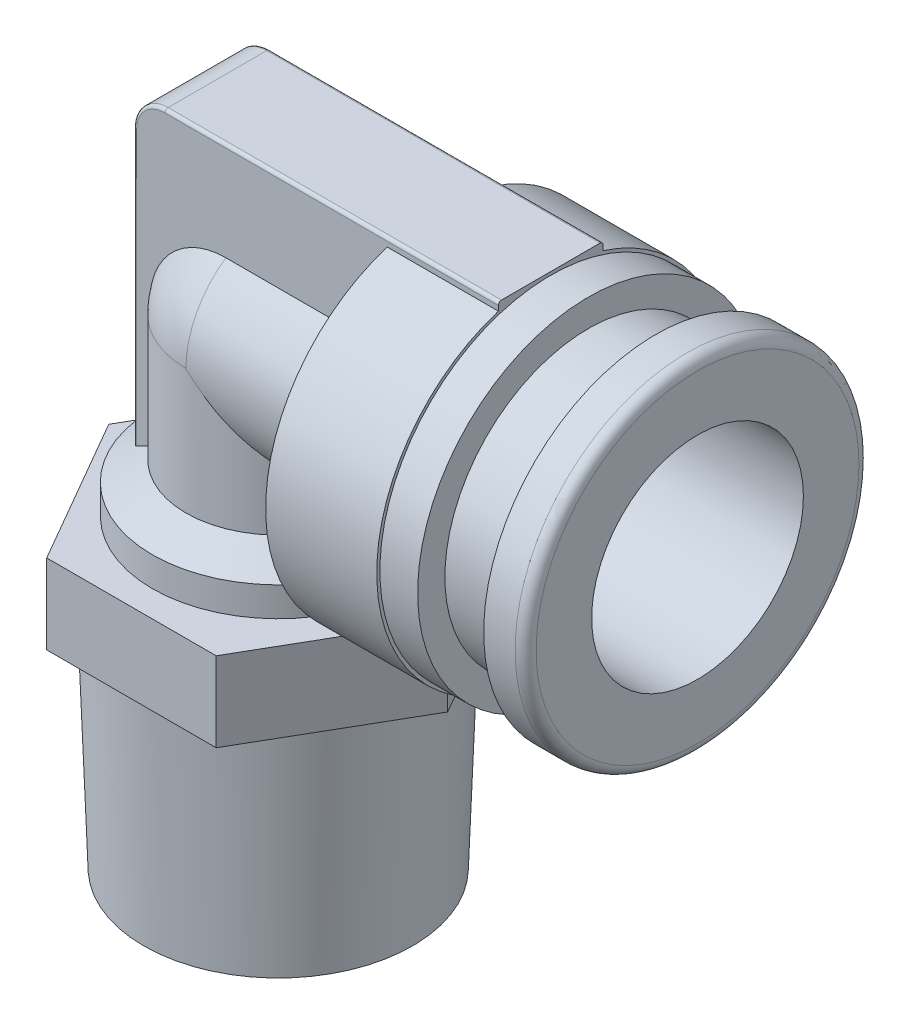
from build123d import *

# Parameters (mm, degrees)
SKETCH1_R                     = 6.5786
BOSS_EXTRUDE1_DEPTH           = 5.75
BOSS_EXTRUDE1_TAPER           = -2
BOSS_EXTRUDE1_OTHER_WAY_DEPTH = 4.75
BOSS_EXTRUDE1_OTHER_WAY_TAPER = 2
BOSS_EXTRUDE2_DEPTH           = 3.8
SKETCH3_R                     = 4.05
BOSS_EXTRUDE3_DEPTH           = 0.25
SKETCH4_R                     = 6
BOSS_EXTRUDE4_DEPTH           = 1.4
SKETCH5_R                     = 6
BOSS_EXTRUDE5_DEPTH           = 0.9241
BOSS_EXTRUDE5_TAPER           = 60
BOSS_EXTRUDE6_DEPTH           = 12.776
BOSS_EXTRUDE6_DEPTH_BACK      = 2
SKETCH6_W                     = 4.4
SKETCH6_H                     = 5
BOSS_EXTRUDE7_DEPTH           = 13
BOSS_EXTRUDE7_DEPTH_BACK      = 2.9
SKETCH7_W                     = 5
SKETCH7_H                     = 8.3
SKETCH8_R                     = 8.3
BOSS_EXTRUDE8_DEPTH           = 5.3
SKETCH9_R                     = 8.3
BOSS_EXTRUDE9_DEPTH           = 1.04
BOSS_EXTRUDE9_TAPER           = 60
SKETCH11_R                    = 4.399411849
BOSS_EXTRUDE11_DEPTH          = 5.976
SKETCH10_R                    = 4.4
BOSS_EXTRUDE10_DEPTH          = 6.66
SKETCH12_W                    = 5
SKETCH12_H                    = 1.5
REVOLVE1_ANGLE                = 90
REVOLVE2_ANGLE                = 90
SKETCH16_R                    = 8.15
BOSS_EXTRUDE12_DEPTH          = 1.8
SKETCH17_R                    = 6.85
BOSS_EXTRUDE13_DEPTH          = 3.2
SKETCH18_R                    = 8.2
BOSS_EXTRUDE14_DEPTH          = 2
SKETCH19_R                    = 5.05
CUT_EXTRUDE3_DEPTH            = 10
SKETCH15_R                    = 2
CUT_EXTRUDE2_DEPTH            = 8
FILLET1_R                     = 0.5
FILLET2_R                     = 0.15


with BuildPart() as part:
    # Sketch1 → Boss-Extrude1 (new body)
    with BuildSketch(Plane(origin=(0, 0, 0), x_dir=(1, 0, 0), z_dir=(0, 1, 0))):
        Circle(SKETCH1_R)
    extrude(amount=BOSS_EXTRUDE1_DEPTH, taper=BOSS_EXTRUDE1_TAPER)

    # Sketch1 → Boss-Extrude1 other way (add)
    with BuildSketch(Plane(origin=(0, 0, 0), x_dir=(1, 0, 0), z_dir=(0, 1, 0))):
        Circle(SKETCH1_R)
    extrude(amount=-BOSS_EXTRUDE1_OTHER_WAY_DEPTH, taper=BOSS_EXTRUDE1_OTHER_WAY_TAPER)

    # Sketch2 → Boss-Extrude2 (add)
    with BuildSketch(Plane(origin=(0, 5.75, 0), x_dir=(1, 0, 0), z_dir=(0, 1, 0))):
        Polygon((-8.082903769, 0), (-4.041451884, -7), (4.041451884, -7), (8.082903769, 0), (4.041451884, 7), (-4.041451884, 7), align=None)
    extrude(amount=BOSS_EXTRUDE2_DEPTH)

    # Sketch3 → Boss-Extrude3 (add)
    with BuildSketch(Plane(origin=(0, 9.55, 0), x_dir=(1, 0, 0), z_dir=(0, 1, 0))):
        with Locations(Location((0, 0, 0), (0, 0, 270))):
            Circle(SKETCH3_R)
    extrude(amount=BOSS_EXTRUDE3_DEPTH)

    # Sketch4 → Boss-Extrude4 (add)
    with BuildSketch(Plane(origin=(0, 9.8, 0), x_dir=(1, 0, 0), z_dir=(0, 1, 0))):
        with Locations(Location((0, 0, 0), (0, 0, 270))):
            Circle(SKETCH4_R)
    extrude(amount=BOSS_EXTRUDE4_DEPTH)

    # Sketch5 → Boss-Extrude5 (add)
    with BuildSketch(Plane(origin=(0, 11.2, 0), x_dir=(1, 0, 0), z_dir=(0, 1, 0))):
        with Locations(Location((0, 0, 0), (0, 0, 270))):
            Circle(SKETCH5_R)
    extrude(amount=BOSS_EXTRUDE5_DEPTH, taper=BOSS_EXTRUDE5_TAPER)

    # Sketch6 → Boss-Extrude6 (add, two sides: drawn at the far end of the back side and taken through both)
    with BuildSketch(Plane(origin=(0, 12.1241, 0), x_dir=(1, 0, 0), z_dir=(0, 1, 0)).offset(-BOSS_EXTRUDE6_DEPTH_BACK)):
        with Locations((-2.2, 0)):
            Rectangle(SKETCH6_W, SKETCH6_H)
    extrude(amount=BOSS_EXTRUDE6_DEPTH + BOSS_EXTRUDE6_DEPTH_BACK)

    # Sketch7 → Boss-Extrude7 (add, two sides: drawn at the far end of the back side and taken through both)
    with BuildSketch(Plane(origin=(0, 0, 0), x_dir=(0, 0, -1), z_dir=(1, 0, 0)).offset(-BOSS_EXTRUDE7_DEPTH_BACK)):
        with Locations((0, 22.2501)):
            Rectangle(SKETCH7_W, SKETCH7_H)
    extrude(amount=BOSS_EXTRUDE7_DEPTH + BOSS_EXTRUDE7_DEPTH_BACK)

    # Sketch8 → Boss-Extrude8 (add)
    with BuildSketch(Plane(origin=(13, 0, 0), x_dir=(0, 0, -1), z_dir=(1, 0, 0))):
        with Locations((0, 18.1001)):
            Circle(SKETCH8_R)
    extrude(amount=-BOSS_EXTRUDE8_DEPTH)

    # Sketch9 → Boss-Extrude9 (add)
    with BuildSketch(Plane.ZY.offset(-7.7)):
        with Locations((0, 18.1001)):
            Circle(SKETCH9_R)
    extrude(amount=BOSS_EXTRUDE9_DEPTH, taper=BOSS_EXTRUDE9_TAPER)

    # Sketch11 → Boss-Extrude11 (add)
    with BuildSketch(Plane(origin=(0, 12.1241, 0), x_dir=(1, 0, 0), z_dir=(0, 1, 0))):
        Circle(SKETCH11_R)
    extrude(amount=BOSS_EXTRUDE11_DEPTH)

    # Sketch10 → Boss-Extrude10 (add)
    with BuildSketch(Plane.ZY.offset(-6.66)):
        with Locations((0, 18.1001)):
            Circle(SKETCH10_R)
    extrude(amount=BOSS_EXTRUDE10_DEPTH)

    # Sketch12 → Revolve1 (revolve)
    with BuildSketch(Plane.ZY.offset(2.9)):
        with Locations((0, 25.6501)):
            Rectangle(SKETCH12_W, SKETCH12_H)
    revolve(axis=Axis((-2.9, 24.9001, 2.5), (0, 0, 1)), revolution_arc=REVOLVE1_ANGLE)

    # Sketch13 → Revolve2 (revolve)
    with BuildSketch(Plane.ZY):
        with BuildLine():
            Line((-4.4, 18.1001), (4.4, 18.1001))
            ThreePointArc((4.4, 18.1001), (0, 22.5001), (-4.4, 18.1001))
        make_face()
    revolve(axis=Axis((0, 18.1001, -4.4), (0, 0, 1)), revolution_arc=REVOLVE2_ANGLE)

    # Sketch16 → Boss-Extrude12 (add)
    with BuildSketch(Plane(origin=(13, 0, 0), x_dir=(0, 0, -1), z_dir=(1, 0, 0))):
        with Locations((0, 18.1001)):
            Circle(SKETCH16_R)
    extrude(amount=BOSS_EXTRUDE12_DEPTH)

    # Sketch17 → Boss-Extrude13 (add)
    with BuildSketch(Plane(origin=(14.8, 0, 0), x_dir=(0, 0, -1), z_dir=(1, 0, 0))):
        with Locations((0, 18.1001)):
            Circle(SKETCH17_R)
    extrude(amount=BOSS_EXTRUDE13_DEPTH)

    # Sketch18 → Boss-Extrude14 (add)
    with BuildSketch(Plane(origin=(18, 0, 0), x_dir=(0, 0, -1), z_dir=(1, 0, 0))):
        with Locations((0, 18.1001)):
            Circle(SKETCH18_R)
    extrude(amount=BOSS_EXTRUDE14_DEPTH)

    # Sketch19 → Cut-Extrude3 (cut)
    with BuildSketch(Plane(origin=(20, 0, 0), x_dir=(0, 0, -1), z_dir=(1, 0, 0))):
        with Locations((0, 18.1001)):
            Circle(SKETCH19_R)
    extrude(amount=-CUT_EXTRUDE3_DEPTH, mode=Mode.SUBTRACT)

    # Sketch15 → Cut-Extrude2 (cut)
    with BuildSketch(Plane.XZ.offset(4.75)):
        with Locations(Location((0, 0, 0), (0, 0, 270))):
            Circle(SKETCH15_R)
    extrude(amount=-CUT_EXTRUDE2_DEPTH, mode=Mode.SUBTRACT)

    # Fillet1
    fillet1_edges = [part.edges().sort_by_distance(p)[0] for p in [
        (20, 18.1001, 8.2),
    ]]
    fillet(fillet1_edges, radius=FILLET1_R)

    # Fillet2
    fillet2_edges = [part.edges().sort_by_distance(p)[0] for p in [
        (-4.4, 18.321222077, 2.5),
        (-3.960660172, 25.960760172, 2.5),
        (-3.960660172, 25.960760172, -2.5),
        (-4.4, 18.321222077, -2.5),
        (5.05, 26.4001, 2.5),
        (5.05, 26.4001, -2.5),
    ]]
    fillet(fillet2_edges, radius=FILLET2_R)


solid = part.part
